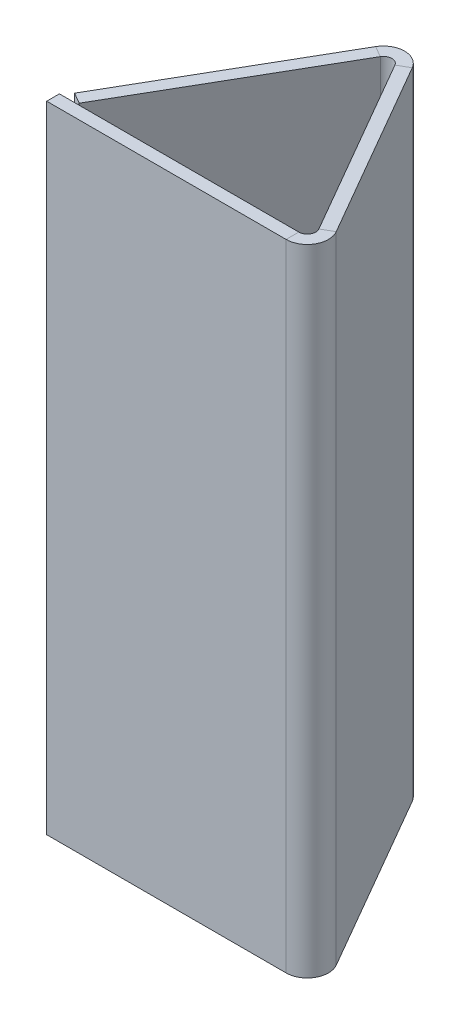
ISO-10303-21;
HEADER;
FILE_DESCRIPTION(('STEP AP214'),'2;1');
FILE_NAME('part.step','',(''),(''),'','','');
FILE_SCHEMA(('AUTOMOTIVE_DESIGN { 1 0 10303 214 1 1 1 1 }'));
ENDSEC;
DATA;
#1=APPLICATION_CONTEXT('core data for automotive mechanical design processes');
#2=APPLICATION_PROTOCOL_DEFINITION('international standard','automotive_design',2000,#1);
#3=PRODUCT_CONTEXT('',#1,'mechanical');
#4=PRODUCT('Part','Part','',(#3));
#5=PRODUCT_RELATED_PRODUCT_CATEGORY('part','',(#4));
#6=PRODUCT_DEFINITION_FORMATION('','',#4);
#7=PRODUCT_DEFINITION_CONTEXT('part definition',#1,'design');
#8=PRODUCT_DEFINITION('design','',#6,#7);
#9=PRODUCT_DEFINITION_SHAPE('','',#8);
#10=(LENGTH_UNIT() NAMED_UNIT(*) SI_UNIT(.MILLI.,.METRE.));
#11=(NAMED_UNIT(*) PLANE_ANGLE_UNIT() SI_UNIT($,.RADIAN.));
#12=(NAMED_UNIT(*) SI_UNIT($,.STERADIAN.) SOLID_ANGLE_UNIT());
#13=UNCERTAINTY_MEASURE_WITH_UNIT(LENGTH_MEASURE(1.E-05),#10,'distance_accuracy_value','');
#14=(GEOMETRIC_REPRESENTATION_CONTEXT(3) GLOBAL_UNCERTAINTY_ASSIGNED_CONTEXT((#13)) GLOBAL_UNIT_ASSIGNED_CONTEXT((#10,
#11,#12)) REPRESENTATION_CONTEXT('',''));
#15=CARTESIAN_POINT('',(0.,0.,0.));
#16=DIRECTION('',(0.,0.,1.));
#17=DIRECTION('',(1.,0.,0.));
#18=AXIS2_PLACEMENT_3D('',#15,#16,#17);
#19=CARTESIAN_POINT('',(4.59807621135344,-75.,-49.9974226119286));
#20=DIRECTION('',(0.,1.,0.));
#21=DIRECTION('',(0.,0.,1.));
#22=AXIS2_PLACEMENT_3D('',#19,#20,#21);
#23=PLANE('',#22);
#24=DIRECTION('',(0.866025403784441,0.,-0.499999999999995));
#25=VECTOR('',#24,1.);
#26=CARTESIAN_POINT('',(3.732050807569,-75.,-45.4974226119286));
#27=LINE('',#26,#25);
#28=CARTESIAN_POINT('',(3.73205080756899,-75.,-45.4974226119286));
#29=VERTEX_POINT('',#28);
#30=CARTESIAN_POINT('',(6.33012701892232,-75.,-46.9974226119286));
#31=VERTEX_POINT('',#30);
#32=EDGE_CURVE('E170',#29,#31,#27,.T.);
#33=ORIENTED_EDGE('',*,*,#32,.T.);
#34=DIRECTION('',(-0.499999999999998,0.,-0.86602540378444));
#35=VECTOR('',#34,1.);
#36=CARTESIAN_POINT('',(4.59807621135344,-75.,-49.9974226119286));
#37=LINE('',#36,#35);
#38=CARTESIAN_POINT('',(30.8660254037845,-75.,-4.5));
#39=VERTEX_POINT('',#38);
#40=EDGE_CURVE('E195',#39,#31,#37,.T.);
#41=ORIENTED_EDGE('',*,*,#40,.F.);
#42=DIRECTION('',(0.86602540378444,0.,-0.499999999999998));
#43=VECTOR('',#42,1.);
#44=CARTESIAN_POINT('',(28.2679491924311,-75.,-3.));
#45=LINE('',#44,#43);
#46=CARTESIAN_POINT('',(28.2679491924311,-75.,-3.00000000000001));
#47=VERTEX_POINT('',#46);
#48=EDGE_CURVE('E187',#47,#39,#45,.T.);
#49=ORIENTED_EDGE('',*,*,#48,.F.);
#50=DIRECTION('',(-0.499999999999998,0.,-0.86602540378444));
#51=VECTOR('',#50,1.);
#52=CARTESIAN_POINT('',(2.00000000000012,-75.,-48.4974226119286));
#53=LINE('',#52,#51);
#54=EDGE_CURVE('E194',#47,#29,#53,.T.);
#55=ORIENTED_EDGE('',*,*,#54,.T.);
#56=EDGE_LOOP('',(#33,#41,#49,#55));
#57=FACE_BOUND('',#56,.T.);
#58=ADVANCED_FACE('F35',(#57),#23,.F.);
#59=CARTESIAN_POINT('',(32.5980762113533,75.,-1.5));
#60=DIRECTION('',(0.,-1.,0.));
#61=DIRECTION('',(0.,0.,-1.));
#62=AXIS2_PLACEMENT_3D('',#59,#60,#61);
#63=PLANE('',#62);
#64=DIRECTION('',(0.866025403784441,0.,-0.499999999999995));
#65=VECTOR('',#64,1.);
#66=CARTESIAN_POINT('',(3.732050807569,75.,-45.4974226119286));
#67=LINE('',#66,#65);
#68=CARTESIAN_POINT('',(3.732050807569,75.,-45.4974226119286));
#69=VERTEX_POINT('',#68);
#70=CARTESIAN_POINT('',(6.33012701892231,75.,-46.9974226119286));
#71=VERTEX_POINT('',#70);
#72=EDGE_CURVE('E179',#69,#71,#67,.T.);
#73=ORIENTED_EDGE('',*,*,#72,.F.);
#74=DIRECTION('',(0.499999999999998,0.,0.86602540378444));
#75=VECTOR('',#74,1.);
#76=CARTESIAN_POINT('',(30.,75.,0.));
#77=LINE('',#76,#75);
#78=CARTESIAN_POINT('',(28.2679491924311,75.,-2.99999999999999));
#79=VERTEX_POINT('',#78);
#80=EDGE_CURVE('E198',#69,#79,#77,.T.);
#81=ORIENTED_EDGE('',*,*,#80,.T.);
#82=DIRECTION('',(0.86602540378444,0.,-0.499999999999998));
#83=VECTOR('',#82,1.);
#84=CARTESIAN_POINT('',(28.2679491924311,75.,-3.));
#85=LINE('',#84,#83);
#86=CARTESIAN_POINT('',(30.8660254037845,75.,-4.49999999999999));
#87=VERTEX_POINT('',#86);
#88=EDGE_CURVE('E182',#79,#87,#85,.T.);
#89=ORIENTED_EDGE('',*,*,#88,.T.);
#90=DIRECTION('',(0.499999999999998,0.,0.86602540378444));
#91=VECTOR('',#90,1.);
#92=CARTESIAN_POINT('',(32.5980762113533,75.,-1.5));
#93=LINE('',#92,#91);
#94=EDGE_CURVE('E197',#71,#87,#93,.T.);
#95=ORIENTED_EDGE('',*,*,#94,.F.);
#96=EDGE_LOOP('',(#73,#81,#89,#95));
#97=FACE_BOUND('',#96,.T.);
#98=ADVANCED_FACE('F300',(#97),#63,.F.);
#99=CARTESIAN_POINT('',(32.5980762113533,-75.,-1.5));
#100=DIRECTION('',(-0.86602540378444,0.,0.499999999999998));
#101=DIRECTION('',(0.499999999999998,0.,0.86602540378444));
#102=AXIS2_PLACEMENT_3D('',#99,#100,#101);
#103=PLANE('',#102);
#104=DIRECTION('',(0.,-1.,0.));
#105=VECTOR('',#104,1.);
#106=CARTESIAN_POINT('',(6.33012701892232,-75.,-46.9974226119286));
#107=LINE('',#106,#105);
#108=EDGE_CURVE('E164',#31,#71,#107,.F.);
#109=ORIENTED_EDGE('',*,*,#108,.T.);
#110=ORIENTED_EDGE('',*,*,#94,.T.);
#111=DIRECTION('',(0.,1.,0.));
#112=VECTOR('',#111,1.);
#113=CARTESIAN_POINT('',(30.8660254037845,-75.,-4.5));
#114=LINE('',#113,#112);
#115=EDGE_CURVE('E190',#39,#87,#114,.T.);
#116=ORIENTED_EDGE('',*,*,#115,.F.);
#117=ORIENTED_EDGE('',*,*,#40,.T.);
#118=EDGE_LOOP('',(#109,#110,#116,#117));
#119=FACE_BOUND('',#118,.T.);
#120=ADVANCED_FACE('F305',(#119),#103,.F.);
#121=CARTESIAN_POINT('',(30.,-75.,0.));
#122=DIRECTION('',(-0.86602540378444,0.,0.499999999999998));
#123=DIRECTION('',(0.499999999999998,0.,0.86602540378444));
#124=AXIS2_PLACEMENT_3D('',#121,#122,#123);
#125=PLANE('',#124);
#126=ORIENTED_EDGE('',*,*,#80,.F.);
#127=DIRECTION('',(0.,-1.,0.));
#128=VECTOR('',#127,1.);
#129=CARTESIAN_POINT('',(3.732050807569,-75.,-45.4974226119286));
#130=LINE('',#129,#128);
#131=EDGE_CURVE('E50',#29,#69,#130,.F.);
#132=ORIENTED_EDGE('',*,*,#131,.F.);
#133=ORIENTED_EDGE('',*,*,#54,.F.);
#134=DIRECTION('',(0.,-1.,0.));
#135=VECTOR('',#134,1.);
#136=CARTESIAN_POINT('',(28.2679491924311,75.,-3.));
#137=LINE('',#136,#135);
#138=EDGE_CURVE('E185',#79,#47,#137,.T.);
#139=ORIENTED_EDGE('',*,*,#138,.F.);
#140=EDGE_LOOP('',(#126,#132,#133,#139));
#141=FACE_BOUND('',#140,.T.);
#142=ADVANCED_FACE('F263',(#141),#125,.T.);
#143=CARTESIAN_POINT('',(30.,-75.,3.));
#144=DIRECTION('',(0.,1.,0.));
#145=DIRECTION('',(0.,0.,1.));
#146=AXIS2_PLACEMENT_3D('',#143,#144,#145);
#147=PLANE('',#146);
#148=DIRECTION('',(0.,0.,1.));
#149=VECTOR('',#148,1.);
#150=CARTESIAN_POINT('',(26.5358983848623,-75.,0.));
#151=LINE('',#150,#149);
#152=CARTESIAN_POINT('',(26.5358983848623,-75.,0.));
#153=VERTEX_POINT('',#152);
#154=CARTESIAN_POINT('',(26.5358983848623,-75.,2.99999999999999));
#155=VERTEX_POINT('',#154);
#156=EDGE_CURVE('E208',#153,#155,#151,.T.);
#157=ORIENTED_EDGE('',*,*,#156,.T.);
#158=DIRECTION('',(1.,0.,0.));
#159=VECTOR('',#158,1.);
#160=CARTESIAN_POINT('',(30.,-75.,3.));
#161=LINE('',#160,#159);
#162=CARTESIAN_POINT('',(-30.,-75.,3.));
#163=VERTEX_POINT('',#162);
#164=EDGE_CURVE('E226',#163,#155,#161,.T.);
#165=ORIENTED_EDGE('',*,*,#164,.F.);
#166=DIRECTION('',(0.,0.,-1.));
#167=VECTOR('',#166,1.);
#168=CARTESIAN_POINT('',(-30.,-75.,3.));
#169=LINE('',#168,#167);
#170=CARTESIAN_POINT('',(-30.,-75.,0.));
#171=VERTEX_POINT('',#170);
#172=EDGE_CURVE('E11',#163,#171,#169,.T.);
#173=ORIENTED_EDGE('',*,*,#172,.T.);
#174=DIRECTION('',(1.,0.,0.));
#175=VECTOR('',#174,1.);
#176=CARTESIAN_POINT('',(30.,-75.,0.));
#177=LINE('',#176,#175);
#178=EDGE_CURVE('E234',#171,#153,#177,.T.);
#179=ORIENTED_EDGE('',*,*,#178,.T.);
#180=EDGE_LOOP('',(#157,#165,#173,#179));
#181=FACE_BOUND('',#180,.T.);
#182=ADVANCED_FACE('F251',(#181),#147,.F.);
#183=CARTESIAN_POINT('',(30.,75.,3.));
#184=DIRECTION('',(0.,-1.,0.));
#185=DIRECTION('',(1.,0.,0.));
#186=AXIS2_PLACEMENT_3D('',#183,#184,#185);
#187=PLANE('',#186);
#188=DIRECTION('',(0.,0.,1.));
#189=VECTOR('',#188,1.);
#190=CARTESIAN_POINT('',(26.5358983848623,75.,0.));
#191=LINE('',#190,#189);
#192=CARTESIAN_POINT('',(26.5358983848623,75.,0.));
#193=VERTEX_POINT('',#192);
#194=CARTESIAN_POINT('',(26.5358983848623,75.,3.));
#195=VERTEX_POINT('',#194);
#196=EDGE_CURVE('E218',#193,#195,#191,.T.);
#197=ORIENTED_EDGE('',*,*,#196,.F.);
#198=DIRECTION('',(-1.,0.,0.));
#199=VECTOR('',#198,1.);
#200=CARTESIAN_POINT('',(30.,75.,0.));
#201=LINE('',#200,#199);
#202=CARTESIAN_POINT('',(-30.,75.,0.));
#203=VERTEX_POINT('',#202);
#204=EDGE_CURVE('E227',#193,#203,#201,.T.);
#205=ORIENTED_EDGE('',*,*,#204,.T.);
#206=DIRECTION('',(0.,0.,-1.));
#207=VECTOR('',#206,1.);
#208=CARTESIAN_POINT('',(-30.,75.,3.));
#209=LINE('',#208,#207);
#210=CARTESIAN_POINT('',(-30.,75.,3.));
#211=VERTEX_POINT('',#210);
#212=EDGE_CURVE('E43',#211,#203,#209,.T.);
#213=ORIENTED_EDGE('',*,*,#212,.F.);
#214=DIRECTION('',(-1.,0.,0.));
#215=VECTOR('',#214,1.);
#216=CARTESIAN_POINT('',(30.,75.,3.));
#217=LINE('',#216,#215);
#218=EDGE_CURVE('E230',#195,#211,#217,.T.);
#219=ORIENTED_EDGE('',*,*,#218,.F.);
#220=EDGE_LOOP('',(#197,#205,#213,#219));
#221=FACE_BOUND('',#220,.T.);
#222=ADVANCED_FACE('F254',(#221),#187,.F.);
#223=CARTESIAN_POINT('',(-30.,75.,3.));
#224=DIRECTION('',(0.,0.,1.));
#225=DIRECTION('',(1.,0.,0.));
#226=AXIS2_PLACEMENT_3D('',#223,#224,#225);
#227=PLANE('',#226);
#228=ORIENTED_EDGE('',*,*,#164,.T.);
#229=DIRECTION('',(0.,-1.,0.));
#230=VECTOR('',#229,1.);
#231=CARTESIAN_POINT('',(26.5358983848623,-75.,2.99999999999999));
#232=LINE('',#231,#230);
#233=EDGE_CURVE('E203',#155,#195,#232,.F.);
#234=ORIENTED_EDGE('',*,*,#233,.T.);
#235=ORIENTED_EDGE('',*,*,#218,.T.);
#236=DIRECTION('',(0.,-1.,0.));
#237=VECTOR('',#236,1.);
#238=CARTESIAN_POINT('',(-30.,-75.,3.));
#239=LINE('',#238,#237);
#240=EDGE_CURVE('E223',#211,#163,#239,.T.);
#241=ORIENTED_EDGE('',*,*,#240,.T.);
#242=EDGE_LOOP('',(#228,#234,#235,#241));
#243=FACE_BOUND('',#242,.T.);
#244=ADVANCED_FACE('F253',(#243),#227,.T.);
#245=CARTESIAN_POINT('',(-30.,75.,0.));
#246=DIRECTION('',(0.,0.,1.));
#247=DIRECTION('',(1.,0.,0.));
#248=AXIS2_PLACEMENT_3D('',#245,#246,#247);
#249=PLANE('',#248);
#250=DIRECTION('',(0.,-1.,0.));
#251=VECTOR('',#250,1.);
#252=CARTESIAN_POINT('',(26.5358983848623,-75.,0.));
#253=LINE('',#252,#251);
#254=EDGE_CURVE('E214',#153,#193,#253,.F.);
#255=ORIENTED_EDGE('',*,*,#254,.F.);
#256=ORIENTED_EDGE('',*,*,#178,.F.);
#257=DIRECTION('',(0.,-1.,0.));
#258=VECTOR('',#257,1.);
#259=CARTESIAN_POINT('',(-30.,-75.,0.));
#260=LINE('',#259,#258);
#261=EDGE_CURVE('E220',#203,#171,#260,.T.);
#262=ORIENTED_EDGE('',*,*,#261,.F.);
#263=ORIENTED_EDGE('',*,*,#204,.F.);
#264=EDGE_LOOP('',(#255,#256,#262,#263));
#265=FACE_BOUND('',#264,.T.);
#266=ADVANCED_FACE('F248',(#265),#249,.F.);
#267=CARTESIAN_POINT('',(-30.,-75.,3.));
#268=DIRECTION('',(1.,0.,0.));
#269=DIRECTION('',(0.,0.,-1.));
#270=AXIS2_PLACEMENT_3D('',#267,#268,#269);
#271=PLANE('',#270);
#272=ORIENTED_EDGE('',*,*,#261,.T.);
#273=ORIENTED_EDGE('',*,*,#172,.F.);
#274=ORIENTED_EDGE('',*,*,#240,.F.);
#275=ORIENTED_EDGE('',*,*,#212,.T.);
#276=EDGE_LOOP('',(#272,#273,#274,#275));
#277=FACE_BOUND('',#276,.T.);
#278=ADVANCED_FACE('F37',(#277),#271,.F.);
#279=CARTESIAN_POINT('',(26.5358983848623,75.,-2.));
#280=DIRECTION('',(0.,1.,0.));
#281=DIRECTION('',(0.,0.,1.));
#282=AXIS2_PLACEMENT_3D('',#279,#280,#281);
#283=PLANE('',#282);
#284=ORIENTED_EDGE('',*,*,#88,.F.);
#285=CARTESIAN_POINT('',(26.5358983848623,75.,-2.));
#286=DIRECTION('',(0.,-1.,0.));
#287=DIRECTION('',(0.,0.,-1.));
#288=AXIS2_PLACEMENT_3D('',#285,#286,#287);
#289=CIRCLE('',#288,2.);
#290=EDGE_CURVE('E211',#193,#79,#289,.F.);
#291=ORIENTED_EDGE('',*,*,#290,.F.);
#292=ORIENTED_EDGE('',*,*,#196,.T.);
#293=CARTESIAN_POINT('',(26.5358983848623,75.,-2.));
#294=DIRECTION('',(0.,-1.,0.));
#295=DIRECTION('',(0.,0.,-1.));
#296=AXIS2_PLACEMENT_3D('',#293,#294,#295);
#297=CIRCLE('',#296,5.);
#298=EDGE_CURVE('E58',#195,#87,#297,.F.);
#299=ORIENTED_EDGE('',*,*,#298,.T.);
#300=EDGE_LOOP('',(#284,#291,#292,#299));
#301=FACE_BOUND('',#300,.T.);
#302=ADVANCED_FACE('F258',(#301),#283,.T.);
#303=CARTESIAN_POINT('',(26.5358983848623,-75.,-2.00000000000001));
#304=DIRECTION('',(0.,1.,0.));
#305=DIRECTION('',(0.,0.,1.));
#306=AXIS2_PLACEMENT_3D('',#303,#304,#305);
#307=PLANE('',#306);
#308=CARTESIAN_POINT('',(26.5358983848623,-75.,-2.00000000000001));
#309=DIRECTION('',(0.,-1.,0.));
#310=DIRECTION('',(0.,0.,-1.));
#311=AXIS2_PLACEMENT_3D('',#308,#309,#310);
#312=CIRCLE('',#311,2.);
#313=EDGE_CURVE('E200',#47,#153,#312,.T.);
#314=ORIENTED_EDGE('',*,*,#313,.F.);
#315=ORIENTED_EDGE('',*,*,#48,.T.);
#316=CARTESIAN_POINT('',(26.5358983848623,-75.,-2.00000000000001));
#317=DIRECTION('',(0.,-1.,0.));
#318=DIRECTION('',(0.,0.,-1.));
#319=AXIS2_PLACEMENT_3D('',#316,#317,#318);
#320=CIRCLE('',#319,5.);
#321=EDGE_CURVE('E206',#39,#155,#320,.T.);
#322=ORIENTED_EDGE('',*,*,#321,.T.);
#323=ORIENTED_EDGE('',*,*,#156,.F.);
#324=EDGE_LOOP('',(#314,#315,#322,#323));
#325=FACE_BOUND('',#324,.T.);
#326=ADVANCED_FACE('F313',(#325),#307,.F.);
#327=CARTESIAN_POINT('',(26.5358983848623,-75.,-2.00000000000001));
#328=DIRECTION('',(0.,-1.,0.));
#329=DIRECTION('',(0.86602540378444,0.,-0.499999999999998));
#330=AXIS2_PLACEMENT_3D('',#327,#328,#329);
#331=CYLINDRICAL_SURFACE('',#330,5.);
#332=ORIENTED_EDGE('',*,*,#233,.F.);
#333=ORIENTED_EDGE('',*,*,#321,.F.);
#334=ORIENTED_EDGE('',*,*,#115,.T.);
#335=ORIENTED_EDGE('',*,*,#298,.F.);
#336=EDGE_LOOP('',(#332,#333,#334,#335));
#337=FACE_BOUND('',#336,.T.);
#338=ADVANCED_FACE('F310',(#337),#331,.T.);
#339=CARTESIAN_POINT('',(26.5358983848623,-75.,-2.00000000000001));
#340=DIRECTION('',(0.,-1.,0.));
#341=DIRECTION('',(0.86602540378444,0.,-0.499999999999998));
#342=AXIS2_PLACEMENT_3D('',#339,#340,#341);
#343=CYLINDRICAL_SURFACE('',#342,2.);
#344=ORIENTED_EDGE('',*,*,#254,.T.);
#345=ORIENTED_EDGE('',*,*,#290,.T.);
#346=ORIENTED_EDGE('',*,*,#138,.T.);
#347=ORIENTED_EDGE('',*,*,#313,.T.);
#348=EDGE_LOOP('',(#344,#345,#346,#347));
#349=FACE_BOUND('',#348,.T.);
#350=ADVANCED_FACE('F261',(#349),#343,.F.);
#351=CARTESIAN_POINT('',(2.00000000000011,75.,-44.4974226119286));
#352=DIRECTION('',(0.,1.,0.));
#353=DIRECTION('',(0.,0.,1.));
#354=AXIS2_PLACEMENT_3D('',#351,#352,#353);
#355=PLANE('',#354);
#356=DIRECTION('',(-0.866025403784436,0.,-0.500000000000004));
#357=VECTOR('',#356,1.);
#358=CARTESIAN_POINT('',(0.267949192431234,75.,-45.4974226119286));
#359=LINE('',#358,#357);
#360=CARTESIAN_POINT('',(0.267949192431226,75.,-45.4974226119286));
#361=VERTEX_POINT('',#360);
#362=CARTESIAN_POINT('',(-2.33012701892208,75.,-46.9974226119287));
#363=VERTEX_POINT('',#362);
#364=EDGE_CURVE('E134',#361,#363,#359,.T.);
#365=ORIENTED_EDGE('',*,*,#364,.F.);
#366=CARTESIAN_POINT('',(2.00000000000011,75.,-44.4974226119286));
#367=DIRECTION('',(0.,-1.,0.));
#368=DIRECTION('',(0.,0.,-1.));
#369=AXIS2_PLACEMENT_3D('',#366,#367,#368);
#370=CIRCLE('',#369,2.00000000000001);
#371=EDGE_CURVE('E173',#69,#361,#370,.F.);
#372=ORIENTED_EDGE('',*,*,#371,.F.);
#373=ORIENTED_EDGE('',*,*,#72,.T.);
#374=CARTESIAN_POINT('',(2.00000000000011,75.,-44.4974226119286));
#375=DIRECTION('',(0.,-1.,0.));
#376=DIRECTION('',(0.,0.,-1.));
#377=AXIS2_PLACEMENT_3D('',#374,#375,#376);
#378=CIRCLE('',#377,5.00000000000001);
#379=EDGE_CURVE('E166',#71,#363,#378,.F.);
#380=ORIENTED_EDGE('',*,*,#379,.T.);
#381=EDGE_LOOP('',(#365,#372,#373,#380));
#382=FACE_BOUND('',#381,.T.);
#383=ADVANCED_FACE('F316',(#382),#355,.T.);
#384=CARTESIAN_POINT('',(2.00000000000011,-75.,-44.4974226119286));
#385=DIRECTION('',(0.,1.,0.));
#386=DIRECTION('',(0.,0.,1.));
#387=AXIS2_PLACEMENT_3D('',#384,#385,#386);
#388=PLANE('',#387);
#389=CARTESIAN_POINT('',(2.00000000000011,-75.,-44.4974226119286));
#390=DIRECTION('',(0.,-1.,0.));
#391=DIRECTION('',(0.,0.,-1.));
#392=AXIS2_PLACEMENT_3D('',#389,#390,#391);
#393=CIRCLE('',#392,2.00000000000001);
#394=CARTESIAN_POINT('',(0.267949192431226,-75.,-45.4974226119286));
#395=VERTEX_POINT('',#394);
#396=EDGE_CURVE('E162',#395,#29,#393,.T.);
#397=ORIENTED_EDGE('',*,*,#396,.F.);
#398=DIRECTION('',(-0.866025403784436,0.,-0.500000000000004));
#399=VECTOR('',#398,1.);
#400=CARTESIAN_POINT('',(0.267949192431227,-75.,-45.4974226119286));
#401=LINE('',#400,#399);
#402=CARTESIAN_POINT('',(-2.33012701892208,-75.,-46.9974226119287));
#403=VERTEX_POINT('',#402);
#404=EDGE_CURVE('E279',#395,#403,#401,.T.);
#405=ORIENTED_EDGE('',*,*,#404,.T.);
#406=CARTESIAN_POINT('',(2.00000000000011,-75.,-44.4974226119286));
#407=DIRECTION('',(0.,-1.,0.));
#408=DIRECTION('',(0.,0.,-1.));
#409=AXIS2_PLACEMENT_3D('',#406,#407,#408);
#410=CIRCLE('',#409,5.00000000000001);
#411=EDGE_CURVE('E167',#403,#31,#410,.T.);
#412=ORIENTED_EDGE('',*,*,#411,.T.);
#413=ORIENTED_EDGE('',*,*,#32,.F.);
#414=EDGE_LOOP('',(#397,#405,#412,#413));
#415=FACE_BOUND('',#414,.T.);
#416=ADVANCED_FACE('F271',(#415),#388,.F.);
#417=CARTESIAN_POINT('',(2.00000000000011,-75.,-44.4974226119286));
#418=DIRECTION('',(0.,-1.,0.));
#419=DIRECTION('',(-0.866025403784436,0.,-0.500000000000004));
#420=AXIS2_PLACEMENT_3D('',#417,#418,#419);
#421=CYLINDRICAL_SURFACE('',#420,5.00000000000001);
#422=ORIENTED_EDGE('',*,*,#108,.F.);
#423=ORIENTED_EDGE('',*,*,#411,.F.);
#424=DIRECTION('',(0.,-1.,0.));
#425=VECTOR('',#424,1.);
#426=CARTESIAN_POINT('',(-2.33012701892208,-75.,-46.9974226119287));
#427=LINE('',#426,#425);
#428=EDGE_CURVE('E158',#363,#403,#427,.T.);
#429=ORIENTED_EDGE('',*,*,#428,.F.);
#430=ORIENTED_EDGE('',*,*,#379,.F.);
#431=EDGE_LOOP('',(#422,#423,#429,#430));
#432=FACE_BOUND('',#431,.T.);
#433=ADVANCED_FACE('F339',(#432),#421,.T.);
#434=CARTESIAN_POINT('',(2.00000000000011,-75.,-44.4974226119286));
#435=DIRECTION('',(0.,-1.,0.));
#436=DIRECTION('',(-0.866025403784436,0.,-0.500000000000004));
#437=AXIS2_PLACEMENT_3D('',#434,#435,#436);
#438=CYLINDRICAL_SURFACE('',#437,2.00000000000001);
#439=ORIENTED_EDGE('',*,*,#131,.T.);
#440=ORIENTED_EDGE('',*,*,#371,.T.);
#441=DIRECTION('',(0.,-1.,0.));
#442=VECTOR('',#441,1.);
#443=CARTESIAN_POINT('',(0.267949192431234,75.,-45.4974226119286));
#444=LINE('',#443,#442);
#445=EDGE_CURVE('E277',#361,#395,#444,.T.);
#446=ORIENTED_EDGE('',*,*,#445,.T.);
#447=ORIENTED_EDGE('',*,*,#396,.T.);
#448=EDGE_LOOP('',(#439,#440,#446,#447));
#449=FACE_BOUND('',#448,.T.);
#450=ADVANCED_FACE('F274',(#449),#438,.F.);
#451=CARTESIAN_POINT('',(-0.598076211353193,-75.,-49.9974226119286));
#452=DIRECTION('',(0.,-1.,0.));
#453=DIRECTION('',(0.,0.,-1.));
#454=AXIS2_PLACEMENT_3D('',#451,#452,#453);
#455=PLANE('',#454);
#456=DIRECTION('',(0.500000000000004,0.,-0.866025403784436));
#457=VECTOR('',#456,1.);
#458=CARTESIAN_POINT('',(-0.598076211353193,-75.,-49.9974226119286));
#459=LINE('',#458,#457);
#460=CARTESIAN_POINT('',(-28.3480762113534,-75.,-1.93301270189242));
#461=VERTEX_POINT('',#460);
#462=EDGE_CURVE('E148',#461,#403,#459,.T.);
#463=ORIENTED_EDGE('',*,*,#462,.T.);
#464=ORIENTED_EDGE('',*,*,#404,.F.);
#465=DIRECTION('',(0.500000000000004,0.,-0.866025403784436));
#466=VECTOR('',#465,1.);
#467=CARTESIAN_POINT('',(2.00000000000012,-75.,-48.4974226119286));
#468=LINE('',#467,#466);
#469=CARTESIAN_POINT('',(-25.7500000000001,-75.,-0.433012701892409));
#470=VERTEX_POINT('',#469);
#471=EDGE_CURVE('E139',#470,#395,#468,.T.);
#472=ORIENTED_EDGE('',*,*,#471,.F.);
#473=DIRECTION('',(0.866025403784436,0.,0.500000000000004));
#474=VECTOR('',#473,1.);
#475=CARTESIAN_POINT('',(-28.3480762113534,-75.,-1.93301270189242));
#476=LINE('',#475,#474);
#477=EDGE_CURVE('E147',#461,#470,#476,.T.);
#478=ORIENTED_EDGE('',*,*,#477,.F.);
#479=EDGE_LOOP('',(#463,#464,#472,#478));
#480=FACE_BOUND('',#479,.T.);
#481=ADVANCED_FACE('F287',(#480),#455,.T.);
#482=CARTESIAN_POINT('',(-28.3480762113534,75.,-1.93301270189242));
#483=DIRECTION('',(0.,1.,0.));
#484=DIRECTION('',(0.,0.,1.));
#485=AXIS2_PLACEMENT_3D('',#482,#483,#484);
#486=PLANE('',#485);
#487=DIRECTION('',(-0.500000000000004,0.,0.866025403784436));
#488=VECTOR('',#487,1.);
#489=CARTESIAN_POINT('',(-25.7500000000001,75.,-0.433012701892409));
#490=LINE('',#489,#488);
#491=CARTESIAN_POINT('',(-25.7500000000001,75.,-0.433012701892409));
#492=VERTEX_POINT('',#491);
#493=EDGE_CURVE('E156',#361,#492,#490,.T.);
#494=ORIENTED_EDGE('',*,*,#493,.F.);
#495=ORIENTED_EDGE('',*,*,#364,.T.);
#496=DIRECTION('',(-0.500000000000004,0.,0.866025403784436));
#497=VECTOR('',#496,1.);
#498=CARTESIAN_POINT('',(-28.3480762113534,75.,-1.93301270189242));
#499=LINE('',#498,#497);
#500=CARTESIAN_POINT('',(-28.3480762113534,75.,-1.93301270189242));
#501=VERTEX_POINT('',#500);
#502=EDGE_CURVE('E128',#363,#501,#499,.T.);
#503=ORIENTED_EDGE('',*,*,#502,.T.);
#504=DIRECTION('',(0.866025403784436,0.,0.500000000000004));
#505=VECTOR('',#504,1.);
#506=CARTESIAN_POINT('',(-28.3480762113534,75.,-1.93301270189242));
#507=LINE('',#506,#505);
#508=EDGE_CURVE('E132',#501,#492,#507,.T.);
#509=ORIENTED_EDGE('',*,*,#508,.T.);
#510=EDGE_LOOP('',(#494,#495,#503,#509));
#511=FACE_BOUND('',#510,.T.);
#512=ADVANCED_FACE('F131',(#511),#486,.T.);
#513=CARTESIAN_POINT('',(-0.598076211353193,-75.,-49.9974226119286));
#514=DIRECTION('',(-0.866025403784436,0.,-0.500000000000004));
#515=DIRECTION('',(-0.500000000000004,0.,0.866025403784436));
#516=AXIS2_PLACEMENT_3D('',#513,#514,#515);
#517=PLANE('',#516);
#518=ORIENTED_EDGE('',*,*,#502,.F.);
#519=ORIENTED_EDGE('',*,*,#428,.T.);
#520=ORIENTED_EDGE('',*,*,#462,.F.);
#521=DIRECTION('',(0.,-1.,0.));
#522=VECTOR('',#521,1.);
#523=CARTESIAN_POINT('',(-28.3480762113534,-75.,-1.93301270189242));
#524=LINE('',#523,#522);
#525=EDGE_CURVE('E138',#501,#461,#524,.T.);
#526=ORIENTED_EDGE('',*,*,#525,.F.);
#527=EDGE_LOOP('',(#518,#519,#520,#526));
#528=FACE_BOUND('',#527,.T.);
#529=ADVANCED_FACE('F150',(#528),#517,.T.);
#530=CARTESIAN_POINT('',(2.00000000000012,-75.,-48.4974226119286));
#531=DIRECTION('',(-0.866025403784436,0.,-0.500000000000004));
#532=DIRECTION('',(-0.500000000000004,0.,0.866025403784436));
#533=AXIS2_PLACEMENT_3D('',#530,#531,#532);
#534=PLANE('',#533);
#535=ORIENTED_EDGE('',*,*,#445,.F.);
#536=ORIENTED_EDGE('',*,*,#493,.T.);
#537=DIRECTION('',(0.,-1.,0.));
#538=VECTOR('',#537,1.);
#539=CARTESIAN_POINT('',(-25.7500000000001,-75.,-0.433012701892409));
#540=LINE('',#539,#538);
#541=EDGE_CURVE('E146',#492,#470,#540,.T.);
#542=ORIENTED_EDGE('',*,*,#541,.T.);
#543=ORIENTED_EDGE('',*,*,#471,.T.);
#544=EDGE_LOOP('',(#535,#536,#542,#543));
#545=FACE_BOUND('',#544,.T.);
#546=ADVANCED_FACE('F289',(#545),#534,.F.);
#547=CARTESIAN_POINT('',(-28.3480762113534,-75.,-1.93301270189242));
#548=DIRECTION('',(-0.500000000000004,0.,0.866025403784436));
#549=DIRECTION('',(0.866025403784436,0.,0.500000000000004));
#550=AXIS2_PLACEMENT_3D('',#547,#548,#549);
#551=PLANE('',#550);
#552=ORIENTED_EDGE('',*,*,#541,.F.);
#553=ORIENTED_EDGE('',*,*,#508,.F.);
#554=ORIENTED_EDGE('',*,*,#525,.T.);
#555=ORIENTED_EDGE('',*,*,#477,.T.);
#556=EDGE_LOOP('',(#552,#553,#554,#555));
#557=FACE_BOUND('',#556,.T.);
#558=ADVANCED_FACE('F143',(#557),#551,.T.);
#559=CLOSED_SHELL('',(#58,#98,#120,#142,#182,#222,#244,#266,#278,#302,#326,#338,#350,#383,#416,
#433,#450,#481,#512,#529,#546,#558));
#560=MANIFOLD_SOLID_BREP('B2',#559);
#561=ADVANCED_BREP_SHAPE_REPRESENTATION('',(#18,#560),#14);
#562=SHAPE_DEFINITION_REPRESENTATION(#9,#561);
ENDSEC;
END-ISO-10303-21;
